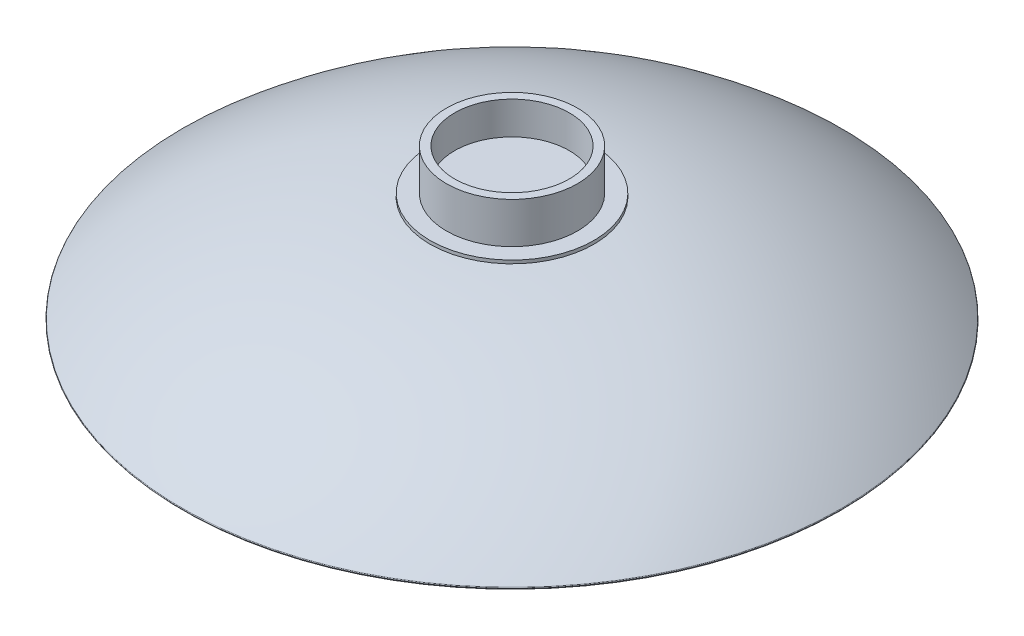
ISO-10303-21;
HEADER;
FILE_DESCRIPTION(('STEP AP214'),'2;1');
FILE_NAME('part.step','',(''),(''),'','','');
FILE_SCHEMA(('AUTOMOTIVE_DESIGN { 1 0 10303 214 1 1 1 1 }'));
ENDSEC;
DATA;
#1=APPLICATION_CONTEXT('core data for automotive mechanical design processes');
#2=APPLICATION_PROTOCOL_DEFINITION('international standard','automotive_design',2000,#1);
#3=PRODUCT_CONTEXT('',#1,'mechanical');
#4=PRODUCT('Part','Part','',(#3));
#5=PRODUCT_RELATED_PRODUCT_CATEGORY('part','',(#4));
#6=PRODUCT_DEFINITION_FORMATION('','',#4);
#7=PRODUCT_DEFINITION_CONTEXT('part definition',#1,'design');
#8=PRODUCT_DEFINITION('design','',#6,#7);
#9=PRODUCT_DEFINITION_SHAPE('','',#8);
#10=(LENGTH_UNIT() NAMED_UNIT(*) SI_UNIT(.MILLI.,.METRE.));
#11=(NAMED_UNIT(*) PLANE_ANGLE_UNIT() SI_UNIT($,.RADIAN.));
#12=(NAMED_UNIT(*) SI_UNIT($,.STERADIAN.) SOLID_ANGLE_UNIT());
#13=UNCERTAINTY_MEASURE_WITH_UNIT(LENGTH_MEASURE(1.E-05),#10,'distance_accuracy_value','');
#14=(GEOMETRIC_REPRESENTATION_CONTEXT(3) GLOBAL_UNCERTAINTY_ASSIGNED_CONTEXT((#13)) GLOBAL_UNIT_ASSIGNED_CONTEXT((#10,
#11,#12)) REPRESENTATION_CONTEXT('',''));
#15=CARTESIAN_POINT('',(0.,0.,0.));
#16=DIRECTION('',(0.,0.,1.));
#17=DIRECTION('',(1.,0.,0.));
#18=AXIS2_PLACEMENT_3D('',#15,#16,#17);
#19=CARTESIAN_POINT('',(-26.8779761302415,-236.633409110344,0.));
#20=DIRECTION('',(0.,0.,-1.));
#21=DIRECTION('',(-1.,0.,0.));
#22=AXIS2_PLACEMENT_3D('',#19,#20,#21);
#23=CIRCLE('',#22,265.);
#24=TRIMMED_CURVE('',#23,(PARAMETER_VALUE(-1.67239736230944)),
(PARAMETER_VALUE(1.67239736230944)),.T.,.PARAMETER.);
#25=CARTESIAN_POINT('',(0.,-236.633409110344,0.));
#26=DIRECTION('',(0.,1.,0.));
#27=AXIS1_PLACEMENT('',#25,#26);
#28=SURFACE_OF_REVOLUTION('',#24,#27);
#29=CARTESIAN_POINT('',(0.,-35.6743256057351,0.));
#30=DIRECTION('',(0.,-1.,0.));
#31=DIRECTION('',(1.,0.,0.));
#32=AXIS2_PLACEMENT_3D('',#29,#30,#31);
#33=CIRCLE('',#32,199.621852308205);
#34=CARTESIAN_POINT('',(199.621852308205,-35.674325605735,0.));
#35=VERTEX_POINT('',#34);
#36=EDGE_CURVE('E56',#35,#35,#33,.T.);
#37=ORIENTED_EDGE('',*,*,#36,.T.);
#38=EDGE_LOOP('',(#37));
#39=FACE_BOUND('',#38,.T.);
#40=CARTESIAN_POINT('',(0.,27.,0.));
#41=VERTEX_POINT('',#40);
#42=VERTEX_LOOP('',#41);
#43=FACE_BOUND('',#42,.T.);
#44=ADVANCED_FACE('F47',(#39,#43),#28,.F.);
#45=CARTESIAN_POINT('',(-26.8779761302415,-236.633409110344,0.));
#46=DIRECTION('',(0.,0.,-1.));
#47=DIRECTION('',(-1.,0.,0.));
#48=AXIS2_PLACEMENT_3D('',#45,#46,#47);
#49=CIRCLE('',#48,267.);
#50=TRIMMED_CURVE('',#49,(PARAMETER_VALUE(-1.67163370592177)),
(PARAMETER_VALUE(1.67163370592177)),.T.,.PARAMETER.);
#51=CARTESIAN_POINT('',(0.,-236.633409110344,0.));
#52=DIRECTION('',(0.,1.,0.));
#53=AXIS1_PLACEMENT('',#51,#52);
#54=SURFACE_OF_REVOLUTION('',#50,#53);
#55=CARTESIAN_POINT('',(0.,-34.1588832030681,0.));
#56=DIRECTION('',(0.,-1.,0.));
#57=DIRECTION('',(1.,0.,0.));
#58=AXIS2_PLACEMENT_3D('',#55,#56,#57);
#59=CIRCLE('',#58,200.927010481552);
#60=CARTESIAN_POINT('',(200.927010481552,-34.1588832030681,0.));
#61=VERTEX_POINT('',#60);
#62=EDGE_CURVE('E13',#61,#61,#59,.F.);
#63=ORIENTED_EDGE('',*,*,#62,.T.);
#64=EDGE_LOOP('',(#63));
#65=FACE_BOUND('',#64,.T.);
#66=CARTESIAN_POINT('',(0.,29.0102891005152,0.));
#67=VERTEX_POINT('',#66);
#68=VERTEX_LOOP('',#67);
#69=FACE_BOUND('',#68,.T.);
#70=ADVANCED_FACE('F62',(#65,#69),#54,.T.);
#71=CARTESIAN_POINT('',(0.,-36.,0.));
#72=DIRECTION('',(0.,1.,0.));
#73=DIRECTION('',(-1.,0.,0.));
#74=AXIS2_PLACEMENT_3D('',#71,#72,#73);
#75=CONICAL_SURFACE('',#74,200.,0.711922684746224);
#76=CARTESIAN_POINT('',(0.,-35.621802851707,0.));
#77=DIRECTION('',(0.,-1.,0.));
#78=DIRECTION('',(1.,0.,0.));
#79=AXIS2_PLACEMENT_3D('',#76,#77,#78);
#80=CIRCLE('',#79,200.326337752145);
#81=CARTESIAN_POINT('',(200.326337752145,-35.621802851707,0.));
#82=VERTEX_POINT('',#81);
#83=EDGE_CURVE('E87',#82,#82,#80,.F.);
#84=ORIENTED_EDGE('',*,*,#83,.T.);
#85=EDGE_LOOP('',(#84));
#86=FACE_BOUND('',#85,.T.);
#87=CARTESIAN_POINT('',(0.,-34.8646943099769,0.));
#88=DIRECTION('',(0.,-1.,0.));
#89=DIRECTION('',(1.,0.,0.));
#90=AXIS2_PLACEMENT_3D('',#87,#88,#89);
#91=CIRCLE('',#90,200.97962956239);
#92=CARTESIAN_POINT('',(200.97962956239,-34.8646943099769,0.));
#93=VERTEX_POINT('',#92);
#94=EDGE_CURVE('E89',#93,#93,#91,.T.);
#95=ORIENTED_EDGE('',*,*,#94,.T.);
#96=EDGE_LOOP('',(#95));
#97=FACE_BOUND('',#96,.T.);
#98=ADVANCED_FACE('F64',(#86,#97),#75,.T.);
#99=CARTESIAN_POINT('',(0.,-35.2951575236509,0.));
#100=DIRECTION('',(0.,-1.,0.));
#101=DIRECTION('',(1.,0.,0.));
#102=AXIS2_PLACEMENT_3D('',#99,#100,#101);
#103=TOROIDAL_SURFACE('',#102,199.94778415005,0.5);
#104=ORIENTED_EDGE('',*,*,#36,.F.);
#105=EDGE_LOOP('',(#104));
#106=FACE_BOUND('',#105,.T.);
#107=ORIENTED_EDGE('',*,*,#83,.F.);
#108=EDGE_LOOP('',(#107));
#109=FACE_BOUND('',#108,.T.);
#110=ADVANCED_FACE('F71',(#106,#109),#103,.T.);
#111=CARTESIAN_POINT('',(0.,-34.5380489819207,0.));
#112=DIRECTION('',(0.,-1.,0.));
#113=DIRECTION('',(1.,0.,0.));
#114=AXIS2_PLACEMENT_3D('',#111,#112,#113);
#115=TOROIDAL_SURFACE('',#114,200.601075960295,0.5);
#116=ORIENTED_EDGE('',*,*,#94,.F.);
#117=EDGE_LOOP('',(#116));
#118=FACE_BOUND('',#117,.T.);
#119=ORIENTED_EDGE('',*,*,#62,.F.);
#120=EDGE_LOOP('',(#119));
#121=FACE_BOUND('',#120,.T.);
#122=ADVANCED_FACE('F49',(#118,#121),#115,.T.);
#123=CLOSED_SHELL('',(#44,#70,#98,#110,#122));
#124=MANIFOLD_SOLID_BREP('B2',#123);
#125=CARTESIAN_POINT('',(0.,57.,0.));
#126=DIRECTION('',(0.,-1.,0.));
#127=DIRECTION('',(0.,0.,-1.));
#128=AXIS2_PLACEMENT_3D('',#125,#126,#127);
#129=CYLINDRICAL_SURFACE('',#128,40.);
#130=CARTESIAN_POINT('',(0.,57.,0.));
#131=DIRECTION('',(0.,1.,0.));
#132=DIRECTION('',(0.,0.,1.));
#133=AXIS2_PLACEMENT_3D('',#130,#131,#132);
#134=CIRCLE('',#133,40.);
#135=CARTESIAN_POINT('',(0.,57.,40.));
#136=VERTEX_POINT('',#135);
#137=EDGE_CURVE('E46',#136,#136,#134,.T.);
#138=ORIENTED_EDGE('',*,*,#137,.F.);
#139=EDGE_LOOP('',(#138));
#140=FACE_BOUND('',#139,.T.);
#141=CARTESIAN_POINT('',(0.,32.,0.));
#142=DIRECTION('',(0.,1.,0.));
#143=DIRECTION('',(0.,0.,1.));
#144=AXIS2_PLACEMENT_3D('',#141,#142,#143);
#145=CIRCLE('',#144,40.);
#146=CARTESIAN_POINT('',(0.,32.,40.));
#147=VERTEX_POINT('',#146);
#148=EDGE_CURVE('E143',#147,#147,#145,.T.);
#149=ORIENTED_EDGE('',*,*,#148,.T.);
#150=EDGE_LOOP('',(#149));
#151=FACE_BOUND('',#150,.T.);
#152=ADVANCED_FACE('F140',(#140,#151),#129,.T.);
#153=CARTESIAN_POINT('',(0.,57.,0.));
#154=DIRECTION('',(0.,1.,0.));
#155=DIRECTION('',(0.,0.,1.));
#156=AXIS2_PLACEMENT_3D('',#153,#154,#155);
#157=PLANE('',#156);
#158=CARTESIAN_POINT('',(0.,57.,0.));
#159=DIRECTION('',(0.,1.,0.));
#160=DIRECTION('',(0.,0.,1.));
#161=AXIS2_PLACEMENT_3D('',#158,#159,#160);
#162=CIRCLE('',#161,35.);
#163=CARTESIAN_POINT('',(0.,57.,35.));
#164=VERTEX_POINT('',#163);
#165=EDGE_CURVE('E154',#164,#164,#162,.T.);
#166=ORIENTED_EDGE('',*,*,#165,.F.);
#167=EDGE_LOOP('',(#166));
#168=FACE_BOUND('',#167,.T.);
#169=ORIENTED_EDGE('',*,*,#137,.T.);
#170=EDGE_LOOP('',(#169));
#171=FACE_BOUND('',#170,.T.);
#172=ADVANCED_FACE('F171',(#168,#171),#157,.T.);
#173=CARTESIAN_POINT('',(0.,32.,0.));
#174=DIRECTION('',(0.,1.,0.));
#175=DIRECTION('',(0.,0.,1.));
#176=AXIS2_PLACEMENT_3D('',#173,#174,#175);
#177=PLANE('',#176);
#178=ORIENTED_EDGE('',*,*,#148,.F.);
#179=EDGE_LOOP('',(#178));
#180=FACE_BOUND('',#179,.T.);
#181=ADVANCED_FACE('F167',(#180),#177,.F.);
#182=CARTESIAN_POINT('',(0.,37.,0.));
#183=DIRECTION('',(0.,1.,0.));
#184=DIRECTION('',(0.,0.,1.));
#185=AXIS2_PLACEMENT_3D('',#182,#183,#184);
#186=CYLINDRICAL_SURFACE('',#185,35.);
#187=CARTESIAN_POINT('',(0.,37.,0.));
#188=DIRECTION('',(0.,1.,0.));
#189=DIRECTION('',(0.,0.,1.));
#190=AXIS2_PLACEMENT_3D('',#187,#188,#189);
#191=CIRCLE('',#190,35.);
#192=CARTESIAN_POINT('',(0.,37.,35.));
#193=VERTEX_POINT('',#192);
#194=EDGE_CURVE('E152',#193,#193,#191,.T.);
#195=ORIENTED_EDGE('',*,*,#194,.F.);
#196=EDGE_LOOP('',(#195));
#197=FACE_BOUND('',#196,.T.);
#198=ORIENTED_EDGE('',*,*,#165,.T.);
#199=EDGE_LOOP('',(#198));
#200=FACE_BOUND('',#199,.T.);
#201=ADVANCED_FACE('F164',(#197,#200),#186,.F.);
#202=CARTESIAN_POINT('',(0.,37.,0.));
#203=DIRECTION('',(0.,1.,0.));
#204=DIRECTION('',(0.,0.,1.));
#205=AXIS2_PLACEMENT_3D('',#202,#203,#204);
#206=PLANE('',#205);
#207=ORIENTED_EDGE('',*,*,#194,.T.);
#208=EDGE_LOOP('',(#207));
#209=FACE_BOUND('',#208,.T.);
#210=ADVANCED_FACE('F162',(#209),#206,.T.);
#211=CLOSED_SHELL('',(#152,#172,#181,#201,#210));
#212=MANIFOLD_SOLID_BREP('B7',#211);
#213=CARTESIAN_POINT('',(0.,32.,0.));
#214=DIRECTION('',(0.,-1.,0.));
#215=DIRECTION('',(0.,0.,-1.));
#216=AXIS2_PLACEMENT_3D('',#213,#214,#215);
#217=CYLINDRICAL_SURFACE('',#216,50.);
#218=CARTESIAN_POINT('',(0.,32.,0.));
#219=DIRECTION('',(0.,1.,0.));
#220=DIRECTION('',(0.,0.,1.));
#221=AXIS2_PLACEMENT_3D('',#218,#219,#220);
#222=CIRCLE('',#221,50.);
#223=CARTESIAN_POINT('',(0.,32.,50.));
#224=VERTEX_POINT('',#223);
#225=EDGE_CURVE('E139',#224,#224,#222,.T.);
#226=ORIENTED_EDGE('',*,*,#225,.F.);
#227=EDGE_LOOP('',(#226));
#228=FACE_BOUND('',#227,.T.);
#229=CARTESIAN_POINT('',(0.,30.,0.));
#230=DIRECTION('',(0.,1.,0.));
#231=DIRECTION('',(0.,0.,1.));
#232=AXIS2_PLACEMENT_3D('',#229,#230,#231);
#233=CIRCLE('',#232,50.);
#234=CARTESIAN_POINT('',(0.,30.,50.));
#235=VERTEX_POINT('',#234);
#236=EDGE_CURVE('E230',#235,#235,#233,.T.);
#237=ORIENTED_EDGE('',*,*,#236,.T.);
#238=EDGE_LOOP('',(#237));
#239=FACE_BOUND('',#238,.T.);
#240=ADVANCED_FACE('F227',(#228,#239),#217,.T.);
#241=CARTESIAN_POINT('',(0.,32.,0.));
#242=DIRECTION('',(0.,1.,0.));
#243=DIRECTION('',(0.,0.,1.));
#244=AXIS2_PLACEMENT_3D('',#241,#242,#243);
#245=PLANE('',#244);
#246=ORIENTED_EDGE('',*,*,#225,.T.);
#247=EDGE_LOOP('',(#246));
#248=FACE_BOUND('',#247,.T.);
#249=ADVANCED_FACE('F244',(#248),#245,.T.);
#250=CARTESIAN_POINT('',(0.,30.,0.));
#251=DIRECTION('',(0.,1.,0.));
#252=DIRECTION('',(0.,0.,1.));
#253=AXIS2_PLACEMENT_3D('',#250,#251,#252);
#254=PLANE('',#253);
#255=ORIENTED_EDGE('',*,*,#236,.F.);
#256=EDGE_LOOP('',(#255));
#257=FACE_BOUND('',#256,.T.);
#258=ADVANCED_FACE('F242',(#257),#254,.F.);
#259=CLOSED_SHELL('',(#240,#249,#258));
#260=MANIFOLD_SOLID_BREP('B41',#259);
#261=CARTESIAN_POINT('',(0.,-10.,0.));
#262=DIRECTION('',(0.,1.,0.));
#263=DIRECTION('',(0.,0.,1.));
#264=AXIS2_PLACEMENT_3D('',#261,#262,#263);
#265=CYLINDRICAL_SURFACE('',#264,50.);
#266=CARTESIAN_POINT('',(0.,0.,0.));
#267=DIRECTION('',(0.,-1.,0.));
#268=DIRECTION('',(0.,0.,-1.));
#269=AXIS2_PLACEMENT_3D('',#266,#267,#268);
#270=CIRCLE('',#269,50.);
#271=CARTESIAN_POINT('',(0.,0.,-50.));
#272=VERTEX_POINT('',#271);
#273=EDGE_CURVE('E226',#272,#272,#270,.F.);
#274=ORIENTED_EDGE('',*,*,#273,.T.);
#275=EDGE_LOOP('',(#274));
#276=FACE_BOUND('',#275,.T.);
#277=CARTESIAN_POINT('',(0.,5.,0.));
#278=DIRECTION('',(0.,-1.,0.));
#279=DIRECTION('',(0.,0.,-1.));
#280=AXIS2_PLACEMENT_3D('',#277,#278,#279);
#281=CIRCLE('',#280,50.);
#282=CARTESIAN_POINT('',(0.,5.,-50.));
#283=VERTEX_POINT('',#282);
#284=EDGE_CURVE('E294',#283,#283,#281,.T.);
#285=ORIENTED_EDGE('',*,*,#284,.T.);
#286=EDGE_LOOP('',(#285));
#287=FACE_BOUND('',#286,.T.);
#288=ADVANCED_FACE('F280',(#276,#287),#265,.T.);
#289=CARTESIAN_POINT('',(0.,-10.,0.));
#290=DIRECTION('',(0.,-1.,0.));
#291=DIRECTION('',(0.,0.,-1.));
#292=AXIS2_PLACEMENT_3D('',#289,#290,#291);
#293=PLANE('',#292);
#294=CARTESIAN_POINT('',(0.,-10.,0.));
#295=DIRECTION('',(0.,-1.,0.));
#296=DIRECTION('',(0.,0.,-1.));
#297=AXIS2_PLACEMENT_3D('',#294,#295,#296);
#298=CIRCLE('',#297,40.);
#299=CARTESIAN_POINT('',(0.,-10.,-40.));
#300=VERTEX_POINT('',#299);
#301=EDGE_CURVE('E288',#300,#300,#298,.T.);
#302=ORIENTED_EDGE('',*,*,#301,.T.);
#303=EDGE_LOOP('',(#302));
#304=FACE_BOUND('',#303,.T.);
#305=ADVANCED_FACE('F304',(#304),#293,.T.);
#306=CARTESIAN_POINT('',(0.,5.,0.));
#307=DIRECTION('',(0.,-1.,0.));
#308=DIRECTION('',(0.,0.,-1.));
#309=AXIS2_PLACEMENT_3D('',#306,#307,#308);
#310=PLANE('',#309);
#311=ORIENTED_EDGE('',*,*,#284,.F.);
#312=EDGE_LOOP('',(#311));
#313=FACE_BOUND('',#312,.T.);
#314=ADVANCED_FACE('F302',(#313),#310,.F.);
#315=CARTESIAN_POINT('',(0.,0.,0.));
#316=DIRECTION('',(0.,-1.,0.));
#317=DIRECTION('',(0.,0.,-1.));
#318=AXIS2_PLACEMENT_3D('',#315,#316,#317);
#319=TOROIDAL_SURFACE('',#318,40.,10.);
#320=ORIENTED_EDGE('',*,*,#273,.F.);
#321=EDGE_LOOP('',(#320));
#322=FACE_BOUND('',#321,.T.);
#323=ORIENTED_EDGE('',*,*,#301,.F.);
#324=EDGE_LOOP('',(#323));
#325=FACE_BOUND('',#324,.T.);
#326=ADVANCED_FACE('F282',(#322,#325),#319,.T.);
#327=CLOSED_SHELL('',(#288,#305,#314,#326));
#328=MANIFOLD_SOLID_BREP('B134',#327);
#329=CARTESIAN_POINT('',(0.,5.,0.));
#330=DIRECTION('',(0.,1.,0.));
#331=DIRECTION('',(0.,0.,1.));
#332=AXIS2_PLACEMENT_3D('',#329,#330,#331);
#333=CYLINDRICAL_SURFACE('',#332,50.);
#334=CARTESIAN_POINT('',(0.,5.,0.));
#335=DIRECTION('',(0.,-1.,0.));
#336=DIRECTION('',(0.,0.,-1.));
#337=AXIS2_PLACEMENT_3D('',#334,#335,#336);
#338=CIRCLE('',#337,50.);
#339=CARTESIAN_POINT('',(0.,5.,-50.));
#340=VERTEX_POINT('',#339);
#341=EDGE_CURVE('E279',#340,#340,#338,.T.);
#342=ORIENTED_EDGE('',*,*,#341,.F.);
#343=EDGE_LOOP('',(#342));
#344=FACE_BOUND('',#343,.T.);
#345=CARTESIAN_POINT('',(0.,25.,0.));
#346=DIRECTION('',(0.,-1.,0.));
#347=DIRECTION('',(0.,0.,-1.));
#348=AXIS2_PLACEMENT_3D('',#345,#346,#347);
#349=CIRCLE('',#348,50.);
#350=CARTESIAN_POINT('',(0.,25.,-50.));
#351=VERTEX_POINT('',#350);
#352=EDGE_CURVE('E352',#351,#351,#349,.T.);
#353=ORIENTED_EDGE('',*,*,#352,.T.);
#354=EDGE_LOOP('',(#353));
#355=FACE_BOUND('',#354,.T.);
#356=ADVANCED_FACE('F349',(#344,#355),#333,.T.);
#357=CARTESIAN_POINT('',(0.,5.,0.));
#358=DIRECTION('',(0.,-1.,0.));
#359=DIRECTION('',(0.,0.,-1.));
#360=AXIS2_PLACEMENT_3D('',#357,#358,#359);
#361=PLANE('',#360);
#362=ORIENTED_EDGE('',*,*,#341,.T.);
#363=EDGE_LOOP('',(#362));
#364=FACE_BOUND('',#363,.T.);
#365=ADVANCED_FACE('F366',(#364),#361,.T.);
#366=CARTESIAN_POINT('',(0.,25.,0.));
#367=DIRECTION('',(0.,-1.,0.));
#368=DIRECTION('',(0.,0.,-1.));
#369=AXIS2_PLACEMENT_3D('',#366,#367,#368);
#370=PLANE('',#369);
#371=ORIENTED_EDGE('',*,*,#352,.F.);
#372=EDGE_LOOP('',(#371));
#373=FACE_BOUND('',#372,.T.);
#374=ADVANCED_FACE('F364',(#373),#370,.F.);
#375=CLOSED_SHELL('',(#356,#365,#374));
#376=MANIFOLD_SOLID_BREP('B221',#375);
#377=CARTESIAN_POINT('',(0.,25.,0.));
#378=DIRECTION('',(0.,1.,0.));
#379=DIRECTION('',(0.,0.,1.));
#380=AXIS2_PLACEMENT_3D('',#377,#378,#379);
#381=CYLINDRICAL_SURFACE('',#380,50.);
#382=CARTESIAN_POINT('',(0.,25.,0.));
#383=DIRECTION('',(0.,-1.,0.));
#384=DIRECTION('',(0.,0.,-1.));
#385=AXIS2_PLACEMENT_3D('',#382,#383,#384);
#386=CIRCLE('',#385,50.);
#387=CARTESIAN_POINT('',(0.,25.,-50.));
#388=VERTEX_POINT('',#387);
#389=EDGE_CURVE('E348',#388,#388,#386,.T.);
#390=ORIENTED_EDGE('',*,*,#389,.F.);
#391=EDGE_LOOP('',(#390));
#392=FACE_BOUND('',#391,.T.);
#393=CARTESIAN_POINT('',(0.,27.,0.));
#394=DIRECTION('',(0.,-1.,0.));
#395=DIRECTION('',(0.,0.,-1.));
#396=AXIS2_PLACEMENT_3D('',#393,#394,#395);
#397=CIRCLE('',#396,50.);
#398=CARTESIAN_POINT('',(0.,27.,-50.));
#399=VERTEX_POINT('',#398);
#400=EDGE_CURVE('E397',#399,#399,#397,.T.);
#401=ORIENTED_EDGE('',*,*,#400,.T.);
#402=EDGE_LOOP('',(#401));
#403=FACE_BOUND('',#402,.T.);
#404=ADVANCED_FACE('F394',(#392,#403),#381,.T.);
#405=CARTESIAN_POINT('',(0.,25.,0.));
#406=DIRECTION('',(0.,-1.,0.));
#407=DIRECTION('',(0.,0.,-1.));
#408=AXIS2_PLACEMENT_3D('',#405,#406,#407);
#409=PLANE('',#408);
#410=ORIENTED_EDGE('',*,*,#389,.T.);
#411=EDGE_LOOP('',(#410));
#412=FACE_BOUND('',#411,.T.);
#413=ADVANCED_FACE('F411',(#412),#409,.T.);
#414=CARTESIAN_POINT('',(0.,27.,0.));
#415=DIRECTION('',(0.,-1.,0.));
#416=DIRECTION('',(0.,0.,-1.));
#417=AXIS2_PLACEMENT_3D('',#414,#415,#416);
#418=PLANE('',#417);
#419=ORIENTED_EDGE('',*,*,#400,.F.);
#420=EDGE_LOOP('',(#419));
#421=FACE_BOUND('',#420,.T.);
#422=ADVANCED_FACE('F409',(#421),#418,.F.);
#423=CLOSED_SHELL('',(#404,#413,#422));
#424=MANIFOLD_SOLID_BREP('B274',#423);
#425=ADVANCED_BREP_SHAPE_REPRESENTATION('',(#18,#124,#212,#260,#328,#376,#424),#14);
#426=SHAPE_DEFINITION_REPRESENTATION(#9,#425);
ENDSEC;
END-ISO-10303-21;
